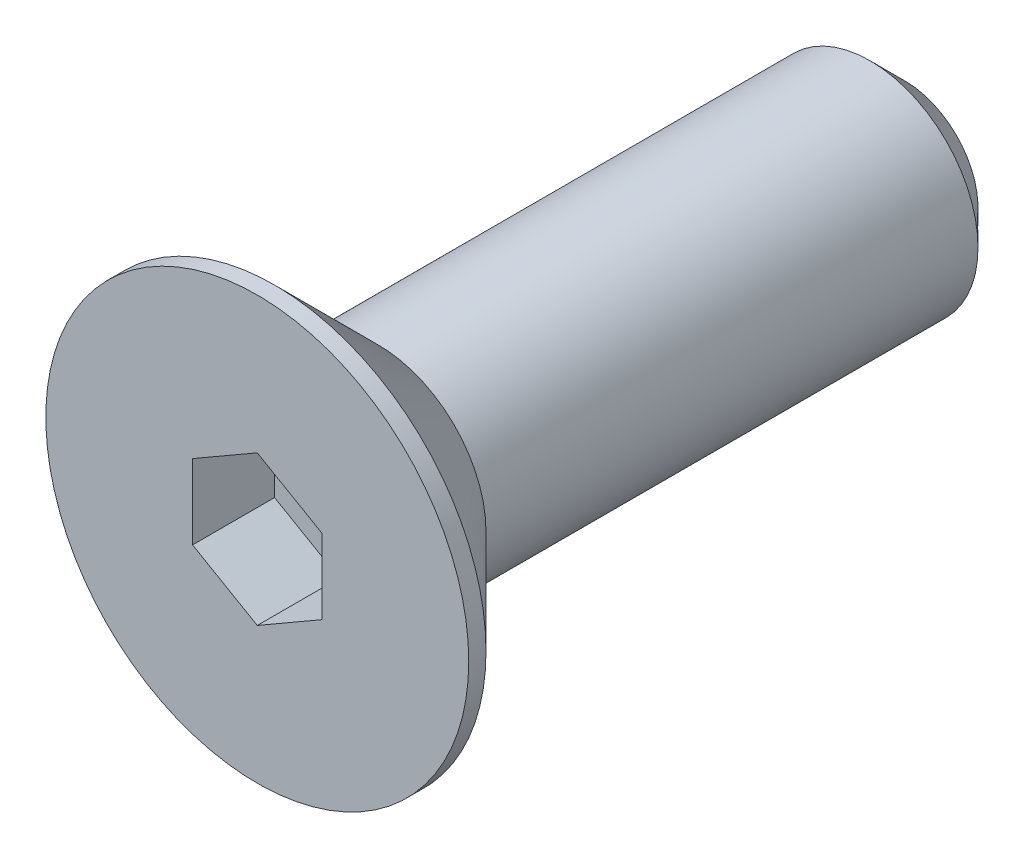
ISO-10303-21;
HEADER;
FILE_DESCRIPTION(('STEP AP214'),'2;1');
FILE_NAME('part.step','',(''),(''),'','','');
FILE_SCHEMA(('AUTOMOTIVE_DESIGN { 1 0 10303 214 1 1 1 1 }'));
ENDSEC;
DATA;
#1=APPLICATION_CONTEXT('core data for automotive mechanical design processes');
#2=APPLICATION_PROTOCOL_DEFINITION('international standard','automotive_design',2000,#1);
#3=PRODUCT_CONTEXT('',#1,'mechanical');
#4=PRODUCT('Part','Part','',(#3));
#5=PRODUCT_RELATED_PRODUCT_CATEGORY('part','',(#4));
#6=PRODUCT_DEFINITION_FORMATION('','',#4);
#7=PRODUCT_DEFINITION_CONTEXT('part definition',#1,'design');
#8=PRODUCT_DEFINITION('design','',#6,#7);
#9=PRODUCT_DEFINITION_SHAPE('','',#8);
#10=(LENGTH_UNIT() NAMED_UNIT(*) SI_UNIT(.MILLI.,.METRE.));
#11=(NAMED_UNIT(*) PLANE_ANGLE_UNIT() SI_UNIT($,.RADIAN.));
#12=(NAMED_UNIT(*) SI_UNIT($,.STERADIAN.) SOLID_ANGLE_UNIT());
#13=UNCERTAINTY_MEASURE_WITH_UNIT(LENGTH_MEASURE(1.E-05),#10,'distance_accuracy_value','');
#14=(GEOMETRIC_REPRESENTATION_CONTEXT(3) GLOBAL_UNCERTAINTY_ASSIGNED_CONTEXT((#13)) GLOBAL_UNIT_ASSIGNED_CONTEXT((#10,
#11,#12)) REPRESENTATION_CONTEXT('',''));
#15=CARTESIAN_POINT('',(0.,0.,0.));
#16=DIRECTION('',(0.,0.,1.));
#17=DIRECTION('',(1.,0.,0.));
#18=AXIS2_PLACEMENT_3D('',#15,#16,#17);
#19=CARTESIAN_POINT('',(0.,0.,0.));
#20=DIRECTION('',(0.,0.,1.));
#21=DIRECTION('',(1.,0.,0.));
#22=AXIS2_PLACEMENT_3D('',#19,#20,#21);
#23=PLANE('',#22);
#24=DIRECTION('',(-0.866025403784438,0.5,0.));
#25=VECTOR('',#24,1.);
#26=CARTESIAN_POINT('',(1.5,0.866025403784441,0.));
#27=LINE('',#26,#25);
#28=CARTESIAN_POINT('',(1.5,0.866025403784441,0.));
#29=VERTEX_POINT('',#28);
#30=CARTESIAN_POINT('',(0.,1.73205080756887,0.));
#31=VERTEX_POINT('',#30);
#32=EDGE_CURVE('E29',#29,#31,#27,.T.);
#33=ORIENTED_EDGE('',*,*,#32,.F.);
#34=DIRECTION('',(0.,1.,0.));
#35=VECTOR('',#34,1.);
#36=CARTESIAN_POINT('',(1.5,-0.866025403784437,0.));
#37=LINE('',#36,#35);
#38=CARTESIAN_POINT('',(1.5,-0.866025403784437,0.));
#39=VERTEX_POINT('',#38);
#40=EDGE_CURVE('E112',#39,#29,#37,.T.);
#41=ORIENTED_EDGE('',*,*,#40,.F.);
#42=DIRECTION('',(0.86602540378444,0.5,0.));
#43=VECTOR('',#42,1.);
#44=CARTESIAN_POINT('',(0.,-1.73205080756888,0.));
#45=LINE('',#44,#43);
#46=CARTESIAN_POINT('',(0.,-1.73205080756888,0.));
#47=VERTEX_POINT('',#46);
#48=EDGE_CURVE('E110',#47,#39,#45,.T.);
#49=ORIENTED_EDGE('',*,*,#48,.F.);
#50=DIRECTION('',(0.866025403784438,-0.5,0.));
#51=VECTOR('',#50,1.);
#52=CARTESIAN_POINT('',(-1.5,-0.866025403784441,0.));
#53=LINE('',#52,#51);
#54=CARTESIAN_POINT('',(-1.5,-0.866025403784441,0.));
#55=VERTEX_POINT('',#54);
#56=EDGE_CURVE('E77',#55,#47,#53,.T.);
#57=ORIENTED_EDGE('',*,*,#56,.F.);
#58=DIRECTION('',(0.,-1.,0.));
#59=VECTOR('',#58,1.);
#60=CARTESIAN_POINT('',(-1.5,0.866025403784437,0.));
#61=LINE('',#60,#59);
#62=CARTESIAN_POINT('',(-1.5,0.866025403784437,0.));
#63=VERTEX_POINT('',#62);
#64=EDGE_CURVE('E106',#63,#55,#61,.T.);
#65=ORIENTED_EDGE('',*,*,#64,.F.);
#66=DIRECTION('',(-0.86602540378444,-0.5,0.));
#67=VECTOR('',#66,1.);
#68=CARTESIAN_POINT('',(0.,1.73205080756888,0.));
#69=LINE('',#68,#67);
#70=EDGE_CURVE('E103',#31,#63,#69,.T.);
#71=ORIENTED_EDGE('',*,*,#70,.F.);
#72=EDGE_LOOP('',(#33,#41,#49,#57,#65,#71));
#73=FACE_BOUND('',#72,.T.);
#74=CARTESIAN_POINT('',(0.,0.,0.));
#75=DIRECTION('',(0.,0.,1.));
#76=DIRECTION('',(1.,0.,0.));
#77=AXIS2_PLACEMENT_3D('',#74,#75,#76);
#78=CIRCLE('',#77,4.9);
#79=CARTESIAN_POINT('',(4.9,0.,0.));
#80=VERTEX_POINT('',#79);
#81=EDGE_CURVE('E127',#80,#80,#78,.T.);
#82=ORIENTED_EDGE('',*,*,#81,.T.);
#83=EDGE_LOOP('',(#82));
#84=FACE_BOUND('',#83,.T.);
#85=ADVANCED_FACE('F14',(#73,#84),#23,.T.);
#86=CARTESIAN_POINT('',(0.,0.,0.));
#87=DIRECTION('',(0.,0.,1.));
#88=DIRECTION('',(1.,0.,0.));
#89=AXIS2_PLACEMENT_3D('',#86,#87,#88);
#90=CYLINDRICAL_SURFACE('',#89,4.9);
#91=CARTESIAN_POINT('',(0.,0.,-0.399999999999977));
#92=DIRECTION('',(0.,0.,1.));
#93=DIRECTION('',(1.,0.,0.));
#94=AXIS2_PLACEMENT_3D('',#91,#92,#93);
#95=CIRCLE('',#94,4.9);
#96=CARTESIAN_POINT('',(4.9,0.,-0.399999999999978));
#97=VERTEX_POINT('',#96);
#98=EDGE_CURVE('E124',#97,#97,#95,.T.);
#99=ORIENTED_EDGE('',*,*,#98,.T.);
#100=EDGE_LOOP('',(#99));
#101=FACE_BOUND('',#100,.T.);
#102=ORIENTED_EDGE('',*,*,#81,.F.);
#103=EDGE_LOOP('',(#102));
#104=FACE_BOUND('',#103,.T.);
#105=ADVANCED_FACE('F151',(#101,#104),#90,.T.);
#106=CARTESIAN_POINT('',(0.,0.,-0.399999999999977));
#107=DIRECTION('',(0.,0.,1.));
#108=DIRECTION('',(1.,0.,0.));
#109=AXIS2_PLACEMENT_3D('',#106,#107,#108);
#110=CONICAL_SURFACE('',#109,4.9,0.785398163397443);
#111=CARTESIAN_POINT('',(0.,0.,-2.8));
#112=DIRECTION('',(0.,0.,1.));
#113=DIRECTION('',(1.,0.,0.));
#114=AXIS2_PLACEMENT_3D('',#111,#112,#113);
#115=CIRCLE('',#114,2.5);
#116=CARTESIAN_POINT('',(2.5,0.,-2.8));
#117=VERTEX_POINT('',#116);
#118=EDGE_CURVE('E116',#117,#117,#115,.T.);
#119=ORIENTED_EDGE('',*,*,#118,.T.);
#120=EDGE_LOOP('',(#119));
#121=FACE_BOUND('',#120,.T.);
#122=ORIENTED_EDGE('',*,*,#98,.F.);
#123=EDGE_LOOP('',(#122));
#124=FACE_BOUND('',#123,.T.);
#125=ADVANCED_FACE('F157',(#121,#124),#110,.T.);
#126=CARTESIAN_POINT('',(0.,0.,0.));
#127=DIRECTION('',(0.,0.,1.));
#128=DIRECTION('',(1.,0.,0.));
#129=AXIS2_PLACEMENT_3D('',#126,#127,#128);
#130=CYLINDRICAL_SURFACE('',#129,2.5);
#131=CARTESIAN_POINT('',(0.,0.,-14.2));
#132=DIRECTION('',(0.,0.,-1.));
#133=DIRECTION('',(-1.,0.,0.));
#134=AXIS2_PLACEMENT_3D('',#131,#132,#133);
#135=CIRCLE('',#134,2.5);
#136=CARTESIAN_POINT('',(-2.5,0.,-14.2));
#137=VERTEX_POINT('',#136);
#138=EDGE_CURVE('E22',#137,#137,#135,.F.);
#139=ORIENTED_EDGE('',*,*,#138,.T.);
#140=EDGE_LOOP('',(#139));
#141=FACE_BOUND('',#140,.T.);
#142=ORIENTED_EDGE('',*,*,#118,.F.);
#143=EDGE_LOOP('',(#142));
#144=FACE_BOUND('',#143,.T.);
#145=ADVANCED_FACE('F132',(#141,#144),#130,.T.);
#146=CARTESIAN_POINT('',(2.5,0.,-15.));
#147=DIRECTION('',(0.,0.,-1.));
#148=DIRECTION('',(-1.,0.,0.));
#149=AXIS2_PLACEMENT_3D('',#146,#147,#148);
#150=PLANE('',#149);
#151=CARTESIAN_POINT('',(0.,0.,-15.));
#152=DIRECTION('',(0.,0.,-1.));
#153=DIRECTION('',(-1.,0.,0.));
#154=AXIS2_PLACEMENT_3D('',#151,#152,#153);
#155=CIRCLE('',#154,1.7);
#156=CARTESIAN_POINT('',(-1.7,0.,-15.));
#157=VERTEX_POINT('',#156);
#158=EDGE_CURVE('E9',#157,#157,#155,.T.);
#159=ORIENTED_EDGE('',*,*,#158,.T.);
#160=EDGE_LOOP('',(#159));
#161=FACE_BOUND('',#160,.T.);
#162=ADVANCED_FACE('F137',(#161),#150,.T.);
#163=CARTESIAN_POINT('',(0.,0.,-14.2));
#164=DIRECTION('',(0.,0.,1.));
#165=DIRECTION('',(1.,0.,0.));
#166=AXIS2_PLACEMENT_3D('',#163,#164,#165);
#167=CONICAL_SURFACE('',#166,2.5,0.785398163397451);
#168=ORIENTED_EDGE('',*,*,#158,.F.);
#169=EDGE_LOOP('',(#168));
#170=FACE_BOUND('',#169,.T.);
#171=ORIENTED_EDGE('',*,*,#138,.F.);
#172=EDGE_LOOP('',(#171));
#173=FACE_BOUND('',#172,.T.);
#174=ADVANCED_FACE('F16',(#170,#173),#167,.T.);
#175=CARTESIAN_POINT('',(1.5,0.866025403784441,-1.9));
#176=DIRECTION('',(0.5,0.86602540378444,0.));
#177=DIRECTION('',(-0.866025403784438,0.5,0.));
#178=AXIS2_PLACEMENT_3D('',#175,#176,#177);
#179=PLANE('',#178);
#180=ORIENTED_EDGE('',*,*,#32,.T.);
#181=DIRECTION('',(0.,0.,1.));
#182=VECTOR('',#181,1.);
#183=CARTESIAN_POINT('',(0.,1.73205080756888,-1.9));
#184=LINE('',#183,#182);
#185=CARTESIAN_POINT('',(0.,1.73205080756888,-1.9));
#186=VERTEX_POINT('',#185);
#187=EDGE_CURVE('E59',#186,#31,#184,.T.);
#188=ORIENTED_EDGE('',*,*,#187,.F.);
#189=DIRECTION('',(-0.866025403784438,0.5,0.));
#190=VECTOR('',#189,1.);
#191=CARTESIAN_POINT('',(1.5,0.866025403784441,-1.9));
#192=LINE('',#191,#190);
#193=CARTESIAN_POINT('',(1.5,0.866025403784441,-1.9));
#194=VERTEX_POINT('',#193);
#195=EDGE_CURVE('E114',#194,#186,#192,.T.);
#196=ORIENTED_EDGE('',*,*,#195,.F.);
#197=DIRECTION('',(0.,0.,1.));
#198=VECTOR('',#197,1.);
#199=CARTESIAN_POINT('',(1.5,0.866025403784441,-1.9));
#200=LINE('',#199,#198);
#201=EDGE_CURVE('E37',#194,#29,#200,.T.);
#202=ORIENTED_EDGE('',*,*,#201,.T.);
#203=EDGE_LOOP('',(#180,#188,#196,#202));
#204=FACE_BOUND('',#203,.T.);
#205=ADVANCED_FACE('F136',(#204),#179,.F.);
#206=CARTESIAN_POINT('',(1.5,-0.866025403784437,-1.9));
#207=DIRECTION('',(1.,0.,0.));
#208=DIRECTION('',(0.,1.,0.));
#209=AXIS2_PLACEMENT_3D('',#206,#207,#208);
#210=PLANE('',#209);
#211=ORIENTED_EDGE('',*,*,#40,.T.);
#212=ORIENTED_EDGE('',*,*,#201,.F.);
#213=DIRECTION('',(0.,1.,0.));
#214=VECTOR('',#213,1.);
#215=CARTESIAN_POINT('',(1.5,-0.866025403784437,-1.9));
#216=LINE('',#215,#214);
#217=CARTESIAN_POINT('',(1.5,-0.866025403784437,-1.9));
#218=VERTEX_POINT('',#217);
#219=EDGE_CURVE('E89',#218,#194,#216,.T.);
#220=ORIENTED_EDGE('',*,*,#219,.F.);
#221=DIRECTION('',(0.,0.,1.));
#222=VECTOR('',#221,1.);
#223=CARTESIAN_POINT('',(1.5,-0.866025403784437,-1.9));
#224=LINE('',#223,#222);
#225=EDGE_CURVE('E81',#218,#39,#224,.T.);
#226=ORIENTED_EDGE('',*,*,#225,.T.);
#227=EDGE_LOOP('',(#211,#212,#220,#226));
#228=FACE_BOUND('',#227,.T.);
#229=ADVANCED_FACE('F145',(#228),#210,.F.);
#230=CARTESIAN_POINT('',(0.,-1.73205080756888,-1.9));
#231=DIRECTION('',(0.5,-0.866025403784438,0.));
#232=DIRECTION('',(0.86602540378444,0.5,0.));
#233=AXIS2_PLACEMENT_3D('',#230,#231,#232);
#234=PLANE('',#233);
#235=ORIENTED_EDGE('',*,*,#48,.T.);
#236=ORIENTED_EDGE('',*,*,#225,.F.);
#237=DIRECTION('',(0.86602540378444,0.5,0.));
#238=VECTOR('',#237,1.);
#239=CARTESIAN_POINT('',(0.,-1.73205080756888,-1.9));
#240=LINE('',#239,#238);
#241=CARTESIAN_POINT('',(0.,-1.73205080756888,-1.9));
#242=VERTEX_POINT('',#241);
#243=EDGE_CURVE('E85',#242,#218,#240,.T.);
#244=ORIENTED_EDGE('',*,*,#243,.F.);
#245=DIRECTION('',(0.,0.,1.));
#246=VECTOR('',#245,1.);
#247=CARTESIAN_POINT('',(0.,-1.73205080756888,-1.9));
#248=LINE('',#247,#246);
#249=EDGE_CURVE('E70',#242,#47,#248,.T.);
#250=ORIENTED_EDGE('',*,*,#249,.T.);
#251=EDGE_LOOP('',(#235,#236,#244,#250));
#252=FACE_BOUND('',#251,.T.);
#253=ADVANCED_FACE('F86',(#252),#234,.F.);
#254=CARTESIAN_POINT('',(-1.5,-0.866025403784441,-1.9));
#255=DIRECTION('',(-0.5,-0.86602540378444,0.));
#256=DIRECTION('',(0.866025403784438,-0.5,0.));
#257=AXIS2_PLACEMENT_3D('',#254,#255,#256);
#258=PLANE('',#257);
#259=ORIENTED_EDGE('',*,*,#56,.T.);
#260=ORIENTED_EDGE('',*,*,#249,.F.);
#261=DIRECTION('',(0.866025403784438,-0.5,0.));
#262=VECTOR('',#261,1.);
#263=CARTESIAN_POINT('',(-1.5,-0.866025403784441,-1.9));
#264=LINE('',#263,#262);
#265=CARTESIAN_POINT('',(-1.5,-0.866025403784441,-1.9));
#266=VERTEX_POINT('',#265);
#267=EDGE_CURVE('E74',#266,#242,#264,.T.);
#268=ORIENTED_EDGE('',*,*,#267,.F.);
#269=DIRECTION('',(0.,0.,1.));
#270=VECTOR('',#269,1.);
#271=CARTESIAN_POINT('',(-1.5,-0.866025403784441,-1.9));
#272=LINE('',#271,#270);
#273=EDGE_CURVE('E82',#266,#55,#272,.T.);
#274=ORIENTED_EDGE('',*,*,#273,.T.);
#275=EDGE_LOOP('',(#259,#260,#268,#274));
#276=FACE_BOUND('',#275,.T.);
#277=ADVANCED_FACE('F72',(#276),#258,.F.);
#278=CARTESIAN_POINT('',(-1.5,0.866025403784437,-1.9));
#279=DIRECTION('',(-1.,0.,0.));
#280=DIRECTION('',(0.,0.,1.));
#281=AXIS2_PLACEMENT_3D('',#278,#279,#280);
#282=PLANE('',#281);
#283=ORIENTED_EDGE('',*,*,#64,.T.);
#284=ORIENTED_EDGE('',*,*,#273,.F.);
#285=DIRECTION('',(0.,-1.,0.));
#286=VECTOR('',#285,1.);
#287=CARTESIAN_POINT('',(-1.5,0.866025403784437,-1.9));
#288=LINE('',#287,#286);
#289=CARTESIAN_POINT('',(-1.5,0.866025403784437,-1.9));
#290=VERTEX_POINT('',#289);
#291=EDGE_CURVE('E95',#290,#266,#288,.T.);
#292=ORIENTED_EDGE('',*,*,#291,.F.);
#293=DIRECTION('',(0.,0.,1.));
#294=VECTOR('',#293,1.);
#295=CARTESIAN_POINT('',(-1.5,0.866025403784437,-1.9));
#296=LINE('',#295,#294);
#297=EDGE_CURVE('E119',#290,#63,#296,.T.);
#298=ORIENTED_EDGE('',*,*,#297,.T.);
#299=EDGE_LOOP('',(#283,#284,#292,#298));
#300=FACE_BOUND('',#299,.T.);
#301=ADVANCED_FACE('F170',(#300),#282,.F.);
#302=CARTESIAN_POINT('',(0.,1.73205080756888,-1.9));
#303=DIRECTION('',(-0.5,0.866025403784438,0.));
#304=DIRECTION('',(-0.86602540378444,-0.5,0.));
#305=AXIS2_PLACEMENT_3D('',#302,#303,#304);
#306=PLANE('',#305);
#307=ORIENTED_EDGE('',*,*,#70,.T.);
#308=ORIENTED_EDGE('',*,*,#297,.F.);
#309=DIRECTION('',(-0.86602540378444,-0.5,0.));
#310=VECTOR('',#309,1.);
#311=CARTESIAN_POINT('',(0.,1.73205080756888,-1.9));
#312=LINE('',#311,#310);
#313=EDGE_CURVE('E97',#186,#290,#312,.T.);
#314=ORIENTED_EDGE('',*,*,#313,.F.);
#315=ORIENTED_EDGE('',*,*,#187,.T.);
#316=EDGE_LOOP('',(#307,#308,#314,#315));
#317=FACE_BOUND('',#316,.T.);
#318=ADVANCED_FACE('F167',(#317),#306,.F.);
#319=CARTESIAN_POINT('',(0.,1.73205080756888,-1.9));
#320=DIRECTION('',(0.,0.,1.));
#321=DIRECTION('',(1.,0.,0.));
#322=AXIS2_PLACEMENT_3D('',#319,#320,#321);
#323=PLANE('',#322);
#324=ORIENTED_EDGE('',*,*,#195,.T.);
#325=ORIENTED_EDGE('',*,*,#313,.T.);
#326=ORIENTED_EDGE('',*,*,#291,.T.);
#327=ORIENTED_EDGE('',*,*,#267,.T.);
#328=ORIENTED_EDGE('',*,*,#243,.T.);
#329=ORIENTED_EDGE('',*,*,#219,.T.);
#330=EDGE_LOOP('',(#324,#325,#326,#327,#328,#329));
#331=FACE_BOUND('',#330,.T.);
#332=ADVANCED_FACE('F92',(#331),#323,.T.);
#333=CLOSED_SHELL('',(#85,#105,#125,#145,#162,#174,#205,#229,#253,#277,#301,#318,#332));
#334=MANIFOLD_SOLID_BREP('B1',#333);
#335=ADVANCED_BREP_SHAPE_REPRESENTATION('',(#18,#334),#14);
#336=SHAPE_DEFINITION_REPRESENTATION(#9,#335);
ENDSEC;
END-ISO-10303-21;
